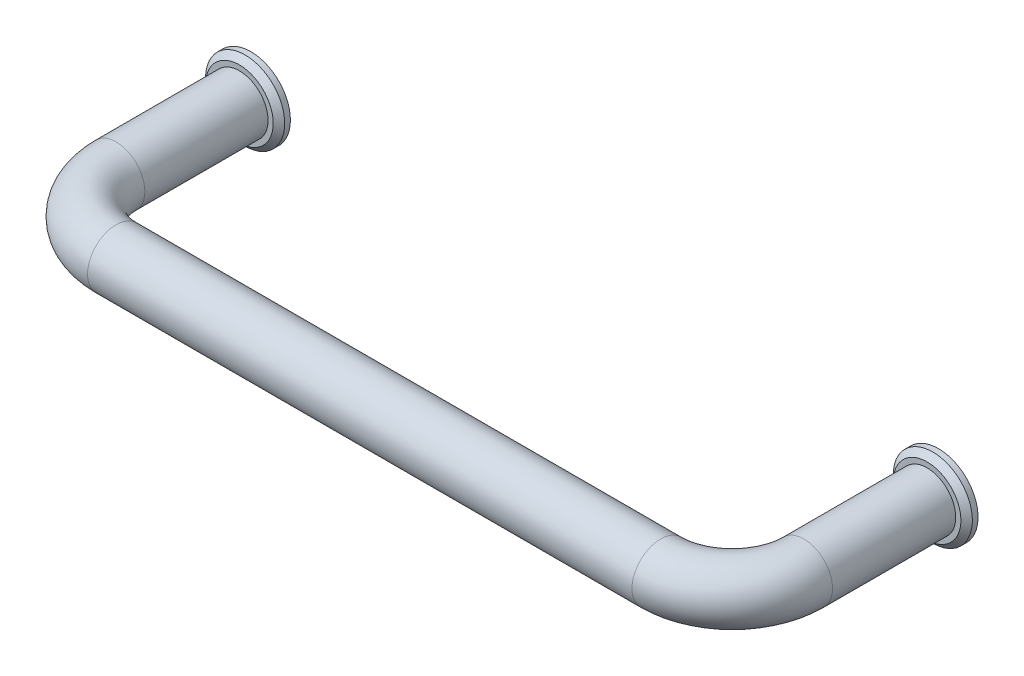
ISO-10303-21;
HEADER;
FILE_DESCRIPTION(('STEP AP214'),'2;1');
FILE_NAME('part.step','',(''),(''),'','','');
FILE_SCHEMA(('AUTOMOTIVE_DESIGN { 1 0 10303 214 1 1 1 1 }'));
ENDSEC;
DATA;
#1=APPLICATION_CONTEXT('core data for automotive mechanical design processes');
#2=APPLICATION_PROTOCOL_DEFINITION('international standard','automotive_design',2000,#1);
#3=PRODUCT_CONTEXT('',#1,'mechanical');
#4=PRODUCT('Part','Part','',(#3));
#5=PRODUCT_RELATED_PRODUCT_CATEGORY('part','',(#4));
#6=PRODUCT_DEFINITION_FORMATION('','',#4);
#7=PRODUCT_DEFINITION_CONTEXT('part definition',#1,'design');
#8=PRODUCT_DEFINITION('design','',#6,#7);
#9=PRODUCT_DEFINITION_SHAPE('','',#8);
#10=(LENGTH_UNIT() NAMED_UNIT(*) SI_UNIT(.MILLI.,.METRE.));
#11=(NAMED_UNIT(*) PLANE_ANGLE_UNIT() SI_UNIT($,.RADIAN.));
#12=(NAMED_UNIT(*) SI_UNIT($,.STERADIAN.) SOLID_ANGLE_UNIT());
#13=UNCERTAINTY_MEASURE_WITH_UNIT(LENGTH_MEASURE(1.E-05),#10,'distance_accuracy_value','');
#14=(GEOMETRIC_REPRESENTATION_CONTEXT(3) GLOBAL_UNCERTAINTY_ASSIGNED_CONTEXT((#13)) GLOBAL_UNIT_ASSIGNED_CONTEXT((#10,
#11,#12)) REPRESENTATION_CONTEXT('',''));
#15=CARTESIAN_POINT('',(0.,0.,0.));
#16=DIRECTION('',(0.,0.,1.));
#17=DIRECTION('',(1.,0.,0.));
#18=AXIS2_PLACEMENT_3D('',#15,#16,#17);
#19=CARTESIAN_POINT('',(0.,0.,0.));
#20=DIRECTION('',(0.,0.,-1.));
#21=DIRECTION('',(0.,1.,0.));
#22=AXIS2_PLACEMENT_3D('',#19,#20,#21);
#23=PLANE('',#22);
#24=CARTESIAN_POINT('',(0.,0.,2.35860593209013E-13));
#25=DIRECTION('',(0.,0.,1.));
#26=DIRECTION('',(1.,0.,0.));
#27=AXIS2_PLACEMENT_3D('',#24,#25,#26);
#28=CIRCLE('',#27,6.9);
#29=CARTESIAN_POINT('',(6.9,0.,4.51313248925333E-13));
#30=VERTEX_POINT('',#29);
#31=EDGE_CURVE('E129',#30,#30,#28,.T.);
#32=ORIENTED_EDGE('',*,*,#31,.F.);
#33=EDGE_LOOP('',(#32));
#34=FACE_BOUND('',#33,.T.);
#35=CARTESIAN_POINT('',(0.,0.,0.));
#36=DIRECTION('',(0.,0.,-1.));
#37=DIRECTION('',(-1.,0.,0.));
#38=AXIS2_PLACEMENT_3D('',#35,#36,#37);
#39=CIRCLE('',#38,2.5);
#40=CARTESIAN_POINT('',(-2.5,0.,0.));
#41=VERTEX_POINT('',#40);
#42=EDGE_CURVE('E127',#41,#41,#39,.T.);
#43=ORIENTED_EDGE('',*,*,#42,.F.);
#44=EDGE_LOOP('',(#43));
#45=FACE_BOUND('',#44,.T.);
#46=ADVANCED_FACE('F12',(#34,#45),#23,.T.);
#47=CARTESIAN_POINT('',(120.,0.,0.));
#48=DIRECTION('',(0.,0.,1.));
#49=DIRECTION('',(0.,1.,0.));
#50=AXIS2_PLACEMENT_3D('',#47,#48,#49);
#51=PLANE('',#50);
#52=CARTESIAN_POINT('',(120.,0.,2.35860593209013E-13));
#53=DIRECTION('',(0.,0.,-1.));
#54=DIRECTION('',(-1.,0.,0.));
#55=AXIS2_PLACEMENT_3D('',#52,#53,#54);
#56=CIRCLE('',#55,6.9);
#57=CARTESIAN_POINT('',(113.1,0.,4.51313248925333E-13));
#58=VERTEX_POINT('',#57);
#59=EDGE_CURVE('E45',#58,#58,#56,.T.);
#60=ORIENTED_EDGE('',*,*,#59,.T.);
#61=EDGE_LOOP('',(#60));
#62=FACE_BOUND('',#61,.T.);
#63=CARTESIAN_POINT('',(120.,0.,0.));
#64=DIRECTION('',(0.,0.,1.));
#65=DIRECTION('',(1.,0.,0.));
#66=AXIS2_PLACEMENT_3D('',#63,#64,#65);
#67=CIRCLE('',#66,2.5);
#68=CARTESIAN_POINT('',(122.5,0.,0.));
#69=VERTEX_POINT('',#68);
#70=EDGE_CURVE('E140',#69,#69,#67,.T.);
#71=ORIENTED_EDGE('',*,*,#70,.T.);
#72=EDGE_LOOP('',(#71));
#73=FACE_BOUND('',#72,.T.);
#74=ADVANCED_FACE('F70',(#62,#73),#51,.F.);
#75=CARTESIAN_POINT('',(0.,0.,23.5));
#76=DIRECTION('',(0.,0.,-1.));
#77=DIRECTION('',(0.,-1.,0.));
#78=AXIS2_PLACEMENT_3D('',#75,#76,#77);
#79=CYLINDRICAL_SURFACE('',#78,5.);
#80=CARTESIAN_POINT('',(0.,0.,2.00000000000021));
#81=DIRECTION('',(0.,0.,1.));
#82=DIRECTION('',(1.,0.,0.));
#83=AXIS2_PLACEMENT_3D('',#80,#81,#82);
#84=CIRCLE('',#83,5.);
#85=CARTESIAN_POINT('',(5.,0.,2.00000000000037));
#86=VERTEX_POINT('',#85);
#87=EDGE_CURVE('E8',#86,#86,#84,.F.);
#88=ORIENTED_EDGE('',*,*,#87,.F.);
#89=EDGE_LOOP('',(#88));
#90=FACE_BOUND('',#89,.T.);
#91=CARTESIAN_POINT('',(0.,0.,23.5));
#92=DIRECTION('',(0.,0.,-1.));
#93=DIRECTION('',(0.,1.,0.));
#94=AXIS2_PLACEMENT_3D('',#91,#92,#93);
#95=CIRCLE('',#94,5.);
#96=CARTESIAN_POINT('',(-5.,0.,23.5));
#97=VERTEX_POINT('',#96);
#98=EDGE_CURVE('E19',#97,#97,#95,.T.);
#99=ORIENTED_EDGE('',*,*,#98,.T.);
#100=EDGE_LOOP('',(#99));
#101=FACE_BOUND('',#100,.T.);
#102=ADVANCED_FACE('F14',(#90,#101),#79,.T.);
#103=CARTESIAN_POINT('',(12.5,0.,23.5));
#104=DIRECTION('',(0.,-1.,0.));
#105=DIRECTION('',(1.,0.,0.));
#106=AXIS2_PLACEMENT_3D('',#103,#104,#105);
#107=TOROIDAL_SURFACE('',#106,12.5,5.);
#108=CARTESIAN_POINT('',(12.5,0.,36.));
#109=DIRECTION('',(-1.,0.,0.));
#110=DIRECTION('',(0.,1.,0.));
#111=AXIS2_PLACEMENT_3D('',#108,#109,#110);
#112=CIRCLE('',#111,5.);
#113=CARTESIAN_POINT('',(12.5,0.,41.));
#114=VERTEX_POINT('',#113);
#115=EDGE_CURVE('E23',#114,#114,#112,.T.);
#116=CARTESIAN_POINT('',(12.5,0.,23.5));
#117=DIRECTION('',(0.,-1.,0.));
#118=DIRECTION('',(1.,0.,0.));
#119=AXIS2_PLACEMENT_3D('',#116,#117,#118);
#120=CIRCLE('',#119,17.5);
#121=EDGE_CURVE('',#114,#97,#120,.T.);
#122=ORIENTED_EDGE('',*,*,#115,.T.);
#123=ORIENTED_EDGE('',*,*,#98,.F.);
#124=ORIENTED_EDGE('',*,*,#121,.T.);
#125=ORIENTED_EDGE('',*,*,#121,.F.);
#126=EDGE_LOOP('',(#122,#124,#123,#125));
#127=FACE_BOUND('',#126,.T.);
#128=ADVANCED_FACE('F67',(#127),#107,.T.);
#129=CARTESIAN_POINT('',(107.5,0.,36.));
#130=DIRECTION('',(-1.,0.,0.));
#131=DIRECTION('',(0.,0.,1.));
#132=AXIS2_PLACEMENT_3D('',#129,#130,#131);
#133=CYLINDRICAL_SURFACE('',#132,5.);
#134=CARTESIAN_POINT('',(107.5,0.,36.));
#135=DIRECTION('',(-1.,0.,0.));
#136=DIRECTION('',(0.,1.,0.));
#137=AXIS2_PLACEMENT_3D('',#134,#135,#136);
#138=CIRCLE('',#137,5.);
#139=CARTESIAN_POINT('',(107.5,0.,41.));
#140=VERTEX_POINT('',#139);
#141=EDGE_CURVE('E28',#140,#140,#138,.T.);
#142=ORIENTED_EDGE('',*,*,#141,.T.);
#143=EDGE_LOOP('',(#142));
#144=FACE_BOUND('',#143,.T.);
#145=ORIENTED_EDGE('',*,*,#115,.F.);
#146=EDGE_LOOP('',(#145));
#147=FACE_BOUND('',#146,.T.);
#148=ADVANCED_FACE('F51',(#144,#147),#133,.T.);
#149=CARTESIAN_POINT('',(107.5,0.,23.5));
#150=DIRECTION('',(0.,-1.,0.));
#151=DIRECTION('',(1.,0.,0.));
#152=AXIS2_PLACEMENT_3D('',#149,#150,#151);
#153=TOROIDAL_SURFACE('',#152,12.5,5.);
#154=CARTESIAN_POINT('',(120.,0.,23.5));
#155=DIRECTION('',(0.,0.,1.));
#156=DIRECTION('',(0.,1.,0.));
#157=AXIS2_PLACEMENT_3D('',#154,#155,#156);
#158=CIRCLE('',#157,5.);
#159=CARTESIAN_POINT('',(125.,0.,23.5));
#160=VERTEX_POINT('',#159);
#161=EDGE_CURVE('E33',#160,#160,#158,.T.);
#162=CARTESIAN_POINT('',(107.5,0.,23.5));
#163=DIRECTION('',(0.,-1.,0.));
#164=DIRECTION('',(1.,0.,0.));
#165=AXIS2_PLACEMENT_3D('',#162,#163,#164);
#166=CIRCLE('',#165,17.5);
#167=EDGE_CURVE('',#160,#140,#166,.T.);
#168=ORIENTED_EDGE('',*,*,#161,.T.);
#169=ORIENTED_EDGE('',*,*,#141,.F.);
#170=ORIENTED_EDGE('',*,*,#167,.T.);
#171=ORIENTED_EDGE('',*,*,#167,.F.);
#172=EDGE_LOOP('',(#168,#170,#169,#171));
#173=FACE_BOUND('',#172,.T.);
#174=ADVANCED_FACE('F54',(#173),#153,.T.);
#175=CARTESIAN_POINT('',(120.,0.,23.5));
#176=DIRECTION('',(0.,0.,-1.));
#177=DIRECTION('',(-1.,0.,0.));
#178=AXIS2_PLACEMENT_3D('',#175,#176,#177);
#179=CYLINDRICAL_SURFACE('',#178,5.);
#180=CARTESIAN_POINT('',(120.,0.,2.00000000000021));
#181=DIRECTION('',(0.,0.,1.));
#182=DIRECTION('',(1.,0.,0.));
#183=AXIS2_PLACEMENT_3D('',#180,#181,#182);
#184=CIRCLE('',#183,5.);
#185=CARTESIAN_POINT('',(125.,0.,2.00000000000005));
#186=VERTEX_POINT('',#185);
#187=EDGE_CURVE('E31',#186,#186,#184,.T.);
#188=ORIENTED_EDGE('',*,*,#187,.T.);
#189=EDGE_LOOP('',(#188));
#190=FACE_BOUND('',#189,.T.);
#191=ORIENTED_EDGE('',*,*,#161,.F.);
#192=EDGE_LOOP('',(#191));
#193=FACE_BOUND('',#192,.T.);
#194=ADVANCED_FACE('F56',(#190,#193),#179,.T.);
#195=CARTESIAN_POINT('',(125.9,0.,2.00000000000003));
#196=DIRECTION('',(0.,0.,1.));
#197=DIRECTION('',(1.,0.,0.));
#198=AXIS2_PLACEMENT_3D('',#195,#196,#197);
#199=PLANE('',#198);
#200=CARTESIAN_POINT('',(120.,0.,2.00000000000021));
#201=DIRECTION('',(0.,0.,-1.));
#202=DIRECTION('',(-1.,0.,0.));
#203=AXIS2_PLACEMENT_3D('',#200,#201,#202);
#204=CIRCLE('',#203,5.89999999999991);
#205=CARTESIAN_POINT('',(114.1,0.,2.00000000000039));
#206=VERTEX_POINT('',#205);
#207=EDGE_CURVE('E40',#206,#206,#204,.T.);
#208=ORIENTED_EDGE('',*,*,#207,.F.);
#209=EDGE_LOOP('',(#208));
#210=FACE_BOUND('',#209,.T.);
#211=ORIENTED_EDGE('',*,*,#187,.F.);
#212=EDGE_LOOP('',(#211));
#213=FACE_BOUND('',#212,.T.);
#214=ADVANCED_FACE('F65',(#210,#213),#199,.T.);
#215=CARTESIAN_POINT('',(120.,0.,0.));
#216=DIRECTION('',(0.,0.,-1.));
#217=DIRECTION('',(-1.,0.,0.));
#218=AXIS2_PLACEMENT_3D('',#215,#216,#217);
#219=CYLINDRICAL_SURFACE('',#218,6.9);
#220=CARTESIAN_POINT('',(120.,0.,1.00000000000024));
#221=DIRECTION('',(0.,0.,-1.));
#222=DIRECTION('',(-1.,0.,0.));
#223=AXIS2_PLACEMENT_3D('',#220,#221,#222);
#224=CIRCLE('',#223,6.9);
#225=CARTESIAN_POINT('',(113.1,0.,1.00000000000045));
#226=VERTEX_POINT('',#225);
#227=EDGE_CURVE('E34',#226,#226,#224,.T.);
#228=ORIENTED_EDGE('',*,*,#227,.T.);
#229=EDGE_LOOP('',(#228));
#230=FACE_BOUND('',#229,.T.);
#231=ORIENTED_EDGE('',*,*,#59,.F.);
#232=EDGE_LOOP('',(#231));
#233=FACE_BOUND('',#232,.T.);
#234=ADVANCED_FACE('F82',(#230,#233),#219,.T.);
#235=CARTESIAN_POINT('',(120.,0.,1.00000000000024));
#236=DIRECTION('',(0.,0.,-1.));
#237=DIRECTION('',(-1.,0.,0.));
#238=AXIS2_PLACEMENT_3D('',#235,#236,#237);
#239=CONICAL_SURFACE('',#238,6.9,0.785398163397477);
#240=ORIENTED_EDGE('',*,*,#207,.T.);
#241=EDGE_LOOP('',(#240));
#242=FACE_BOUND('',#241,.T.);
#243=ORIENTED_EDGE('',*,*,#227,.F.);
#244=EDGE_LOOP('',(#243));
#245=FACE_BOUND('',#244,.T.);
#246=ADVANCED_FACE('F85',(#242,#245),#239,.T.);
#247=CARTESIAN_POINT('',(122.5,0.,11.));
#248=DIRECTION('',(0.,0.,-1.));
#249=DIRECTION('',(-1.,0.,0.));
#250=AXIS2_PLACEMENT_3D('',#247,#248,#249);
#251=PLANE('',#250);
#252=CARTESIAN_POINT('',(120.,0.,11.));
#253=DIRECTION('',(0.,0.,1.));
#254=DIRECTION('',(1.,0.,0.));
#255=AXIS2_PLACEMENT_3D('',#252,#253,#254);
#256=CIRCLE('',#255,2.5);
#257=CARTESIAN_POINT('',(122.5,0.,11.));
#258=VERTEX_POINT('',#257);
#259=EDGE_CURVE('E143',#258,#258,#256,.T.);
#260=ORIENTED_EDGE('',*,*,#259,.F.);
#261=EDGE_LOOP('',(#260));
#262=FACE_BOUND('',#261,.T.);
#263=ADVANCED_FACE('F88',(#262),#251,.T.);
#264=CARTESIAN_POINT('',(120.,0.,14.6933830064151));
#265=DIRECTION('',(0.,0.,1.));
#266=DIRECTION('',(1.,0.,0.));
#267=AXIS2_PLACEMENT_3D('',#264,#265,#266);
#268=CYLINDRICAL_SURFACE('',#267,2.5);
#269=ORIENTED_EDGE('',*,*,#259,.T.);
#270=EDGE_LOOP('',(#269));
#271=FACE_BOUND('',#270,.T.);
#272=ORIENTED_EDGE('',*,*,#70,.F.);
#273=EDGE_LOOP('',(#272));
#274=FACE_BOUND('',#273,.T.);
#275=ADVANCED_FACE('F95',(#271,#274),#268,.F.);
#276=CARTESIAN_POINT('',(0.,0.,0.));
#277=DIRECTION('',(0.,0.,-1.));
#278=DIRECTION('',(1.,0.,0.));
#279=AXIS2_PLACEMENT_3D('',#276,#277,#278);
#280=CYLINDRICAL_SURFACE('',#279,6.9);
#281=CARTESIAN_POINT('',(0.,0.,1.00000000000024));
#282=DIRECTION('',(0.,0.,1.));
#283=DIRECTION('',(1.,0.,0.));
#284=AXIS2_PLACEMENT_3D('',#281,#282,#283);
#285=CIRCLE('',#284,6.9);
#286=CARTESIAN_POINT('',(6.9,0.,1.00000000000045));
#287=VERTEX_POINT('',#286);
#288=EDGE_CURVE('E137',#287,#287,#285,.T.);
#289=ORIENTED_EDGE('',*,*,#288,.F.);
#290=EDGE_LOOP('',(#289));
#291=FACE_BOUND('',#290,.T.);
#292=ORIENTED_EDGE('',*,*,#31,.T.);
#293=EDGE_LOOP('',(#292));
#294=FACE_BOUND('',#293,.T.);
#295=ADVANCED_FACE('F99',(#291,#294),#280,.T.);
#296=CARTESIAN_POINT('',(0.,0.,1.00000000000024));
#297=DIRECTION('',(0.,0.,-1.));
#298=DIRECTION('',(1.,0.,0.));
#299=AXIS2_PLACEMENT_3D('',#296,#297,#298);
#300=CONICAL_SURFACE('',#299,6.9,0.785398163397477);
#301=CARTESIAN_POINT('',(0.,0.,2.00000000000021));
#302=DIRECTION('',(0.,0.,1.));
#303=DIRECTION('',(1.,0.,0.));
#304=AXIS2_PLACEMENT_3D('',#301,#302,#303);
#305=CIRCLE('',#304,5.89999999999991);
#306=CARTESIAN_POINT('',(5.89999999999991,0.,2.00000000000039));
#307=VERTEX_POINT('',#306);
#308=EDGE_CURVE('E134',#307,#307,#305,.T.);
#309=ORIENTED_EDGE('',*,*,#308,.F.);
#310=EDGE_LOOP('',(#309));
#311=FACE_BOUND('',#310,.T.);
#312=ORIENTED_EDGE('',*,*,#288,.T.);
#313=EDGE_LOOP('',(#312));
#314=FACE_BOUND('',#313,.T.);
#315=ADVANCED_FACE('F103',(#311,#314),#300,.T.);
#316=CARTESIAN_POINT('',(-5.9,0.,2.00000000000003));
#317=DIRECTION('',(0.,0.,1.));
#318=DIRECTION('',(-1.,0.,0.));
#319=AXIS2_PLACEMENT_3D('',#316,#317,#318);
#320=PLANE('',#319);
#321=ORIENTED_EDGE('',*,*,#87,.T.);
#322=EDGE_LOOP('',(#321));
#323=FACE_BOUND('',#322,.T.);
#324=ORIENTED_EDGE('',*,*,#308,.T.);
#325=EDGE_LOOP('',(#324));
#326=FACE_BOUND('',#325,.T.);
#327=ADVANCED_FACE('F107',(#323,#326),#320,.T.);
#328=CARTESIAN_POINT('',(-2.5,0.,11.));
#329=DIRECTION('',(0.,0.,-1.));
#330=DIRECTION('',(1.,0.,0.));
#331=AXIS2_PLACEMENT_3D('',#328,#329,#330);
#332=PLANE('',#331);
#333=CARTESIAN_POINT('',(0.,0.,11.));
#334=DIRECTION('',(0.,0.,-1.));
#335=DIRECTION('',(-1.,0.,0.));
#336=AXIS2_PLACEMENT_3D('',#333,#334,#335);
#337=CIRCLE('',#336,2.5);
#338=CARTESIAN_POINT('',(-2.5,0.,11.));
#339=VERTEX_POINT('',#338);
#340=EDGE_CURVE('E124',#339,#339,#337,.T.);
#341=ORIENTED_EDGE('',*,*,#340,.T.);
#342=EDGE_LOOP('',(#341));
#343=FACE_BOUND('',#342,.T.);
#344=ADVANCED_FACE('F111',(#343),#332,.T.);
#345=CARTESIAN_POINT('',(0.,0.,14.6933830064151));
#346=DIRECTION('',(0.,0.,1.));
#347=DIRECTION('',(-1.,0.,0.));
#348=AXIS2_PLACEMENT_3D('',#345,#346,#347);
#349=CYLINDRICAL_SURFACE('',#348,2.5);
#350=ORIENTED_EDGE('',*,*,#340,.F.);
#351=EDGE_LOOP('',(#350));
#352=FACE_BOUND('',#351,.T.);
#353=ORIENTED_EDGE('',*,*,#42,.T.);
#354=EDGE_LOOP('',(#353));
#355=FACE_BOUND('',#354,.T.);
#356=ADVANCED_FACE('F114',(#352,#355),#349,.F.);
#357=CLOSED_SHELL('',(#46,#74,#102,#128,#148,#174,#194,#214,#234,#246,#263,#275,#295,#315,#327,
#344,#356));
#358=MANIFOLD_SOLID_BREP('B1',#357);
#359=ADVANCED_BREP_SHAPE_REPRESENTATION('',(#18,#358),#14);
#360=SHAPE_DEFINITION_REPRESENTATION(#9,#359);
ENDSEC;
END-ISO-10303-21;
